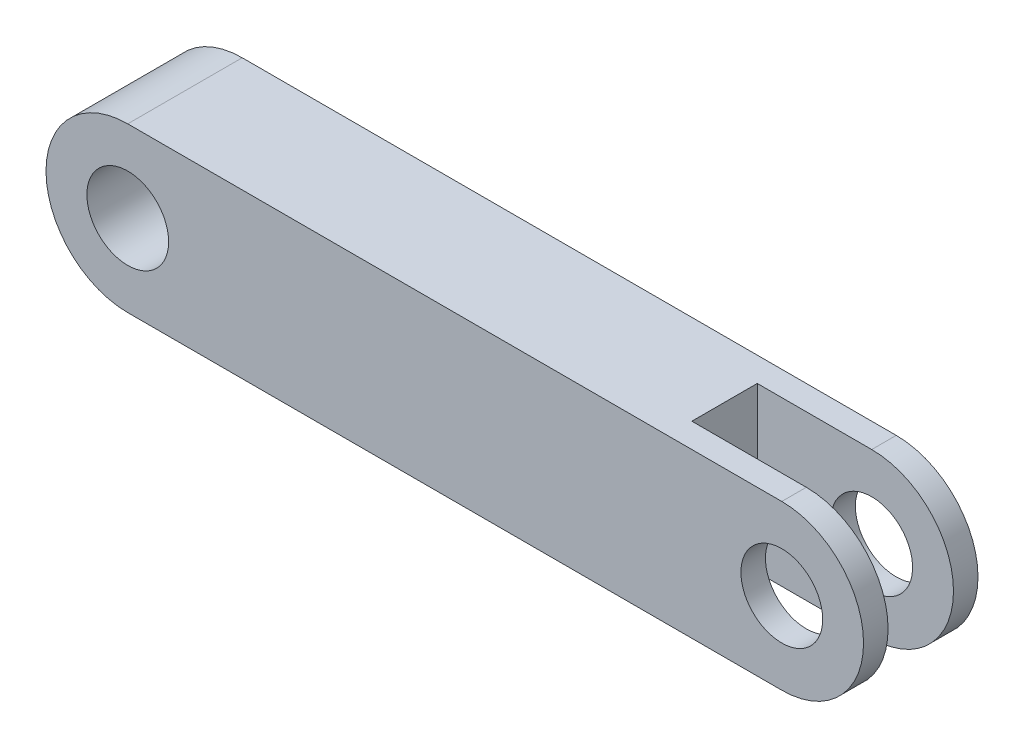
from build123d import *

# Parameters (mm, degrees)
SKETCH1_R          = 2.5
EXTRUDE2_DEPTH     = 3.5
CUT_EXTRUDE1_REACH = 48.23
SKETCH2_W          = 12
SKETCH2_H          = 4


with BuildPart() as part:
    # Sketch1 → Extrude2 (new, symmetric)
    with BuildSketch(Plane.XY):
        with BuildLine():
            Line((0, 0), (40, 0))
            ThreePointArc((40, 0), (45, -5), (40, -10))
            Line((40, -10), (0, -10))
            ThreePointArc((0, -10), (-5, -5), (0, 0))
        make_face()
        with Locations((0, -5)):
            Circle(SKETCH1_R, mode=Mode.SUBTRACT)
        with Locations((40, -5)):
            Circle(SKETCH1_R, mode=Mode.SUBTRACT)
    extrude(amount=EXTRUDE2_DEPTH, both=True)

    # Sketch2 → Cut-Extrude1 (cut, up to next)
    with BuildSketch(Plane(origin=(0, 0, 0), x_dir=(-1, 0, 0), z_dir=(0, 1, 0)), mode=Mode.PRIVATE) as cut_extrude1_sk1:
        with Locations((-39, 0)):
            Rectangle(SKETCH2_W, SKETCH2_H)
    cut_extrude1_tool1 = extrude(cut_extrude1_sk1.sketch, amount=-CUT_EXTRUDE1_REACH, mode=Mode.PRIVATE) & part.part
    add(cut_extrude1_tool1.solids().sort_by_distance((39, 0, 0))[0], mode=Mode.SUBTRACT)


solid = part.part
